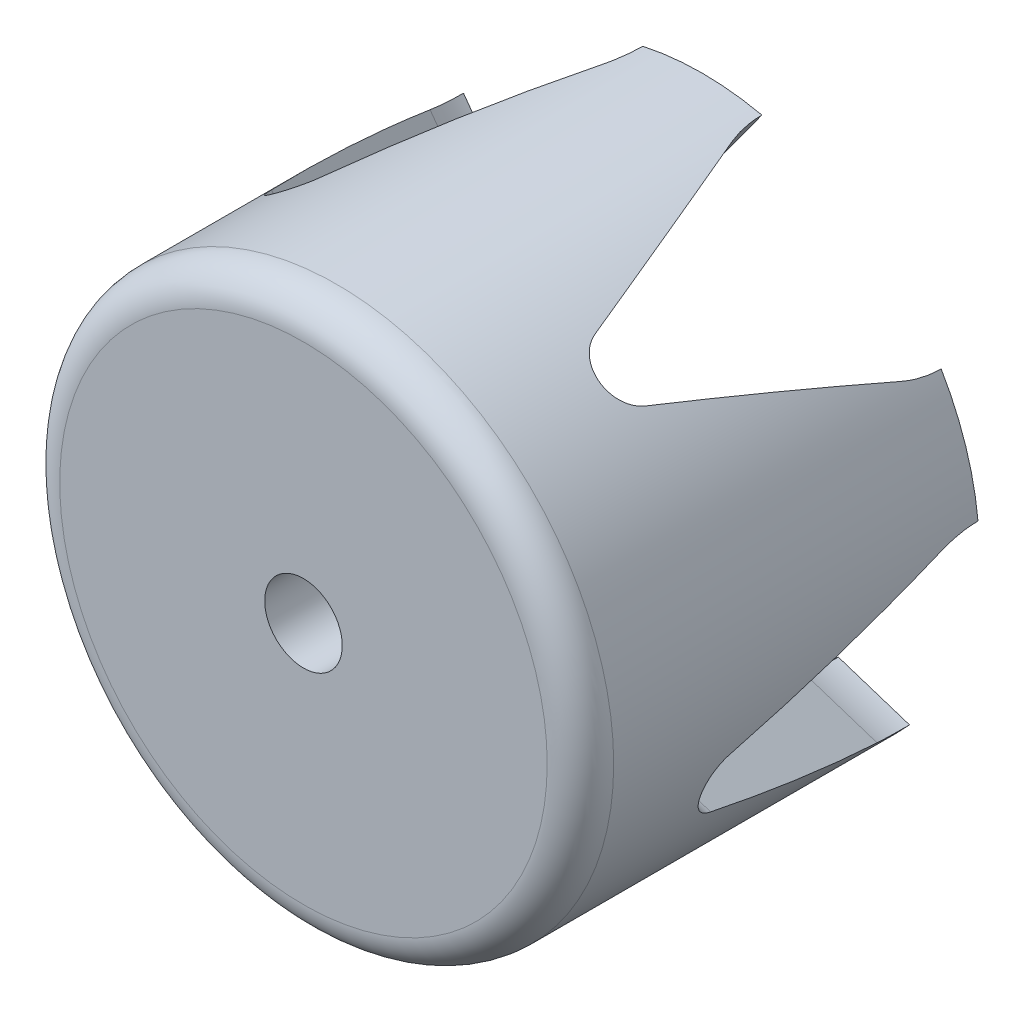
from build123d import *

# Parameters (mm, degrees)
SKETCH1_R           = 12.5
SKETCH1_R_2         = 9.5
BOSS_EXTRUDE1_DEPTH = 15
SKETCH2_R           = 12.5
BOSS_EXTRUDE2_DEPTH = 3
SKETCH3_R           = 1.75
CUT_EXTRUDE1_DEPTH  = 26.228951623
FILLET1_R           = 1.5
CUT_EXTRUDE2_DEPTH  = 26.228951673
CIRPATTERN1_COUNT   = 5


with BuildPart() as part:
    # Sketch1 → Boss-Extrude1 (new body)
    with BuildSketch(Plane.XY):
        Circle(SKETCH1_R)
        Circle(SKETCH1_R_2, mode=Mode.SUBTRACT)
    extrude(amount=BOSS_EXTRUDE1_DEPTH)

    # Sketch2 → Boss-Extrude2 (add)
    with BuildSketch(Plane.XY.offset(15)):
        Circle(SKETCH2_R)
    extrude(amount=BOSS_EXTRUDE2_DEPTH)

    # Sketch3 → Cut-Extrude1 (cut, through all)
    with BuildSketch(Plane.XY.offset(18)):
        Circle(SKETCH3_R)
    extrude(amount=-CUT_EXTRUDE1_DEPTH, mode=Mode.SUBTRACT)

    # Fillet1
    fillet1_edges = [part.edges().sort_by_distance(p)[0] for p in [
        (-12.5, 0, 18),
    ]]
    fillet(fillet1_edges, radius=FILLET1_R)

    # Sketch4 → Cut-Extrude2 (cut, through all)
    with BuildSketch(Plane(origin=(0, 0, 0), x_dir=(1, 0, 0), z_dir=(0, 1, 0))):
        with BuildLine():
            Line((-4.714045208, -1.666666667), (-1.414213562, -11))
            ThreePointArc((-1.414213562, -11), (0, -12), (1.414213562, -11))
            Line((1.414213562, -11), (4.714045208, -1.666666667))
            ThreePointArc((4.714045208, -1.666666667), (0, 5), (-4.714045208, -1.666666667))
        make_face()
    cut_extrude2 = extrude(amount=-CUT_EXTRUDE2_DEPTH, mode=Mode.SUBTRACT)

    # CirPattern1: Cut-Extrude2 ×5 about axis
    cirpattern1_axis = Axis((0, 0, 0), (0, 0, 1))
    for i in range(1, CIRPATTERN1_COUNT):
        add(cut_extrude2.rotate(cirpattern1_axis, i * 360 / CIRPATTERN1_COUNT), mode=Mode.SUBTRACT)


solid = part.part
